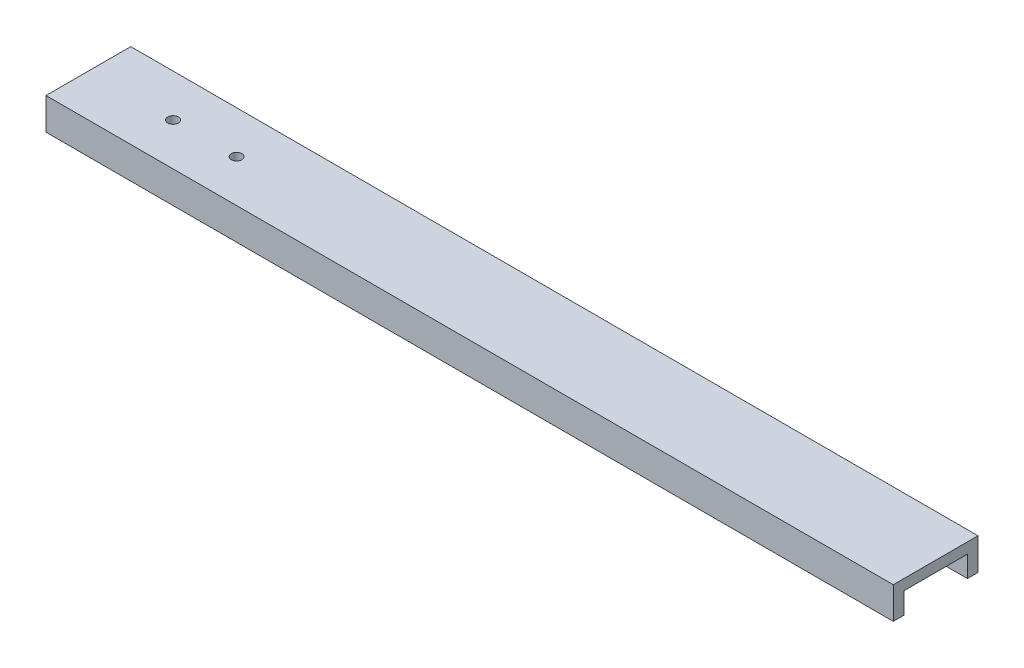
ISO-10303-21;
HEADER;
FILE_DESCRIPTION(('STEP AP214'),'2;1');
FILE_NAME('part.step','',(''),(''),'','','');
FILE_SCHEMA(('AUTOMOTIVE_DESIGN { 1 0 10303 214 1 1 1 1 }'));
ENDSEC;
DATA;
#1=APPLICATION_CONTEXT('core data for automotive mechanical design processes');
#2=APPLICATION_PROTOCOL_DEFINITION('international standard','automotive_design',2000,#1);
#3=PRODUCT_CONTEXT('',#1,'mechanical');
#4=PRODUCT('Part','Part','',(#3));
#5=PRODUCT_RELATED_PRODUCT_CATEGORY('part','',(#4));
#6=PRODUCT_DEFINITION_FORMATION('','',#4);
#7=PRODUCT_DEFINITION_CONTEXT('part definition',#1,'design');
#8=PRODUCT_DEFINITION('design','',#6,#7);
#9=PRODUCT_DEFINITION_SHAPE('','',#8);
#10=(LENGTH_UNIT() NAMED_UNIT(*) SI_UNIT(.MILLI.,.METRE.));
#11=(NAMED_UNIT(*) PLANE_ANGLE_UNIT() SI_UNIT($,.RADIAN.));
#12=(NAMED_UNIT(*) SI_UNIT($,.STERADIAN.) SOLID_ANGLE_UNIT());
#13=UNCERTAINTY_MEASURE_WITH_UNIT(LENGTH_MEASURE(1.E-05),#10,'distance_accuracy_value','');
#14=(GEOMETRIC_REPRESENTATION_CONTEXT(3) GLOBAL_UNCERTAINTY_ASSIGNED_CONTEXT((#13)) GLOBAL_UNIT_ASSIGNED_CONTEXT((#10,
#11,#12)) REPRESENTATION_CONTEXT('',''));
#15=CARTESIAN_POINT('',(0.,0.,0.));
#16=DIRECTION('',(0.,0.,1.));
#17=DIRECTION('',(1.,0.,0.));
#18=AXIS2_PLACEMENT_3D('',#15,#16,#17);
#19=CARTESIAN_POINT('',(254.,-12.7,19.05));
#20=DIRECTION('',(0.,1.,0.));
#21=DIRECTION('',(0.,0.,1.));
#22=AXIS2_PLACEMENT_3D('',#19,#20,#21);
#23=PLANE('',#22);
#24=DIRECTION('',(0.,0.,-1.));
#25=VECTOR('',#24,1.);
#26=CARTESIAN_POINT('',(-254.,-12.7,19.05));
#27=LINE('',#26,#25);
#28=CARTESIAN_POINT('',(-254.,-12.7,25.4));
#29=VERTEX_POINT('',#28);
#30=CARTESIAN_POINT('',(-254.,-12.7,19.05));
#31=VERTEX_POINT('',#30);
#32=EDGE_CURVE('E140',#29,#31,#27,.T.);
#33=ORIENTED_EDGE('',*,*,#32,.T.);
#34=DIRECTION('',(-1.,0.,0.));
#35=VECTOR('',#34,1.);
#36=CARTESIAN_POINT('',(254.,-12.7,19.05));
#37=LINE('',#36,#35);
#38=CARTESIAN_POINT('',(254.,-12.7,19.05));
#39=VERTEX_POINT('',#38);
#40=EDGE_CURVE('E11',#39,#31,#37,.T.);
#41=ORIENTED_EDGE('',*,*,#40,.F.);
#42=DIRECTION('',(0.,0.,-1.));
#43=VECTOR('',#42,1.);
#44=CARTESIAN_POINT('',(254.,-12.7,19.05));
#45=LINE('',#44,#43);
#46=CARTESIAN_POINT('',(254.,-12.7,25.4));
#47=VERTEX_POINT('',#46);
#48=EDGE_CURVE('E163',#47,#39,#45,.T.);
#49=ORIENTED_EDGE('',*,*,#48,.F.);
#50=DIRECTION('',(-1.,0.,0.));
#51=VECTOR('',#50,1.);
#52=CARTESIAN_POINT('',(254.,-12.7,25.4));
#53=LINE('',#52,#51);
#54=EDGE_CURVE('E136',#47,#29,#53,.T.);
#55=ORIENTED_EDGE('',*,*,#54,.T.);
#56=EDGE_LOOP('',(#33,#41,#49,#55));
#57=FACE_BOUND('',#56,.T.);
#58=ADVANCED_FACE('F39',(#57),#23,.F.);
#59=CARTESIAN_POINT('',(254.,0.,19.05));
#60=DIRECTION('',(0.,0.,1.));
#61=DIRECTION('',(0.,-1.,0.));
#62=AXIS2_PLACEMENT_3D('',#59,#60,#61);
#63=PLANE('',#62);
#64=DIRECTION('',(0.,1.,0.));
#65=VECTOR('',#64,1.);
#66=CARTESIAN_POINT('',(-254.,0.,19.05));
#67=LINE('',#66,#65);
#68=CARTESIAN_POINT('',(-254.,0.,19.05));
#69=VERTEX_POINT('',#68);
#70=EDGE_CURVE('E144',#31,#69,#67,.T.);
#71=ORIENTED_EDGE('',*,*,#70,.T.);
#72=DIRECTION('',(-1.,0.,0.));
#73=VECTOR('',#72,1.);
#74=CARTESIAN_POINT('',(254.,0.,19.05));
#75=LINE('',#74,#73);
#76=CARTESIAN_POINT('',(254.,0.,19.05));
#77=VERTEX_POINT('',#76);
#78=EDGE_CURVE('E48',#77,#69,#75,.T.);
#79=ORIENTED_EDGE('',*,*,#78,.F.);
#80=DIRECTION('',(0.,1.,0.));
#81=VECTOR('',#80,1.);
#82=CARTESIAN_POINT('',(254.,0.,19.05));
#83=LINE('',#82,#81);
#84=EDGE_CURVE('E99',#39,#77,#83,.T.);
#85=ORIENTED_EDGE('',*,*,#84,.F.);
#86=ORIENTED_EDGE('',*,*,#40,.T.);
#87=EDGE_LOOP('',(#71,#79,#85,#86));
#88=FACE_BOUND('',#87,.T.);
#89=ADVANCED_FACE('F239',(#88),#63,.F.);
#90=CARTESIAN_POINT('',(254.,0.,-19.05));
#91=DIRECTION('',(0.,1.,0.));
#92=DIRECTION('',(0.,0.,1.));
#93=AXIS2_PLACEMENT_3D('',#90,#91,#92);
#94=PLANE('',#93);
#95=CARTESIAN_POINT('',(-203.2,0.,0.));
#96=DIRECTION('',(0.,1.,0.));
#97=DIRECTION('',(0.,0.,1.));
#98=AXIS2_PLACEMENT_3D('',#95,#96,#97);
#99=CIRCLE('',#98,3.175);
#100=CARTESIAN_POINT('',(-203.2,0.,3.175));
#101=VERTEX_POINT('',#100);
#102=EDGE_CURVE('E145',#101,#101,#99,.T.);
#103=ORIENTED_EDGE('',*,*,#102,.T.);
#104=EDGE_LOOP('',(#103));
#105=FACE_BOUND('',#104,.T.);
#106=CARTESIAN_POINT('',(-165.1,0.,0.));
#107=DIRECTION('',(0.,1.,0.));
#108=DIRECTION('',(0.,0.,1.));
#109=AXIS2_PLACEMENT_3D('',#106,#107,#108);
#110=CIRCLE('',#109,3.175);
#111=CARTESIAN_POINT('',(-165.1,0.,3.175));
#112=VERTEX_POINT('',#111);
#113=EDGE_CURVE('E210',#112,#112,#110,.T.);
#114=ORIENTED_EDGE('',*,*,#113,.T.);
#115=EDGE_LOOP('',(#114));
#116=FACE_BOUND('',#115,.T.);
#117=DIRECTION('',(0.,0.,-1.));
#118=VECTOR('',#117,1.);
#119=CARTESIAN_POINT('',(-254.,0.,-19.05));
#120=LINE('',#119,#118);
#121=CARTESIAN_POINT('',(-254.,0.,-19.05));
#122=VERTEX_POINT('',#121);
#123=EDGE_CURVE('E148',#69,#122,#120,.T.);
#124=ORIENTED_EDGE('',*,*,#123,.T.);
#125=DIRECTION('',(-1.,0.,0.));
#126=VECTOR('',#125,1.);
#127=CARTESIAN_POINT('',(254.,0.,-19.05));
#128=LINE('',#127,#126);
#129=CARTESIAN_POINT('',(254.,0.,-19.05));
#130=VERTEX_POINT('',#129);
#131=EDGE_CURVE('E174',#130,#122,#128,.T.);
#132=ORIENTED_EDGE('',*,*,#131,.F.);
#133=DIRECTION('',(0.,0.,-1.));
#134=VECTOR('',#133,1.);
#135=CARTESIAN_POINT('',(254.,0.,-19.05));
#136=LINE('',#135,#134);
#137=EDGE_CURVE('E184',#77,#130,#136,.T.);
#138=ORIENTED_EDGE('',*,*,#137,.F.);
#139=ORIENTED_EDGE('',*,*,#78,.T.);
#140=EDGE_LOOP('',(#124,#132,#138,#139));
#141=FACE_BOUND('',#140,.T.);
#142=ADVANCED_FACE('F182',(#105,#116,#141),#94,.F.);
#143=CARTESIAN_POINT('',(254.,-12.7,-19.05));
#144=DIRECTION('',(0.,0.,-1.));
#145=DIRECTION('',(-1.,0.,0.));
#146=AXIS2_PLACEMENT_3D('',#143,#144,#145);
#147=PLANE('',#146);
#148=DIRECTION('',(0.,-1.,0.));
#149=VECTOR('',#148,1.);
#150=CARTESIAN_POINT('',(-254.,-12.7,-19.05));
#151=LINE('',#150,#149);
#152=CARTESIAN_POINT('',(-254.,-12.7,-19.05));
#153=VERTEX_POINT('',#152);
#154=EDGE_CURVE('E151',#122,#153,#151,.T.);
#155=ORIENTED_EDGE('',*,*,#154,.T.);
#156=DIRECTION('',(-1.,0.,0.));
#157=VECTOR('',#156,1.);
#158=CARTESIAN_POINT('',(254.,-12.7,-19.05));
#159=LINE('',#158,#157);
#160=CARTESIAN_POINT('',(254.,-12.7,-19.05));
#161=VERTEX_POINT('',#160);
#162=EDGE_CURVE('E170',#161,#153,#159,.T.);
#163=ORIENTED_EDGE('',*,*,#162,.F.);
#164=DIRECTION('',(0.,-1.,0.));
#165=VECTOR('',#164,1.);
#166=CARTESIAN_POINT('',(254.,-12.7,-19.05));
#167=LINE('',#166,#165);
#168=EDGE_CURVE('E197',#130,#161,#167,.T.);
#169=ORIENTED_EDGE('',*,*,#168,.F.);
#170=ORIENTED_EDGE('',*,*,#131,.T.);
#171=EDGE_LOOP('',(#155,#163,#169,#170));
#172=FACE_BOUND('',#171,.T.);
#173=ADVANCED_FACE('F192',(#172),#147,.F.);
#174=CARTESIAN_POINT('',(254.,-12.7,-25.4));
#175=DIRECTION('',(0.,1.,0.));
#176=DIRECTION('',(0.,0.,1.));
#177=AXIS2_PLACEMENT_3D('',#174,#175,#176);
#178=PLANE('',#177);
#179=DIRECTION('',(0.,0.,-1.));
#180=VECTOR('',#179,1.);
#181=CARTESIAN_POINT('',(-254.,-12.7,-25.4));
#182=LINE('',#181,#180);
#183=CARTESIAN_POINT('',(-254.,-12.7,-25.4));
#184=VERTEX_POINT('',#183);
#185=EDGE_CURVE('E154',#153,#184,#182,.T.);
#186=ORIENTED_EDGE('',*,*,#185,.T.);
#187=DIRECTION('',(-1.,0.,0.));
#188=VECTOR('',#187,1.);
#189=CARTESIAN_POINT('',(254.,-12.7,-25.4));
#190=LINE('',#189,#188);
#191=CARTESIAN_POINT('',(254.,-12.7,-25.4));
#192=VERTEX_POINT('',#191);
#193=EDGE_CURVE('E129',#192,#184,#190,.T.);
#194=ORIENTED_EDGE('',*,*,#193,.F.);
#195=DIRECTION('',(0.,0.,-1.));
#196=VECTOR('',#195,1.);
#197=CARTESIAN_POINT('',(254.,-12.7,-25.4));
#198=LINE('',#197,#196);
#199=EDGE_CURVE('E118',#161,#192,#198,.T.);
#200=ORIENTED_EDGE('',*,*,#199,.F.);
#201=ORIENTED_EDGE('',*,*,#162,.T.);
#202=EDGE_LOOP('',(#186,#194,#200,#201));
#203=FACE_BOUND('',#202,.T.);
#204=ADVANCED_FACE('F195',(#203),#178,.F.);
#205=CARTESIAN_POINT('',(254.,6.35000000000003,-25.4));
#206=DIRECTION('',(0.,0.,1.));
#207=DIRECTION('',(0.,-1.,0.));
#208=AXIS2_PLACEMENT_3D('',#205,#206,#207);
#209=PLANE('',#208);
#210=DIRECTION('',(0.,1.,0.));
#211=VECTOR('',#210,1.);
#212=CARTESIAN_POINT('',(-254.,6.35000000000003,-25.4));
#213=LINE('',#212,#211);
#214=CARTESIAN_POINT('',(-254.,6.35000000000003,-25.4));
#215=VERTEX_POINT('',#214);
#216=EDGE_CURVE('E127',#184,#215,#213,.T.);
#217=ORIENTED_EDGE('',*,*,#216,.T.);
#218=DIRECTION('',(-1.,0.,0.));
#219=VECTOR('',#218,1.);
#220=CARTESIAN_POINT('',(254.,6.35000000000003,-25.4));
#221=LINE('',#220,#219);
#222=CARTESIAN_POINT('',(254.,6.35000000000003,-25.4));
#223=VERTEX_POINT('',#222);
#224=EDGE_CURVE('E124',#223,#215,#221,.T.);
#225=ORIENTED_EDGE('',*,*,#224,.F.);
#226=DIRECTION('',(0.,1.,0.));
#227=VECTOR('',#226,1.);
#228=CARTESIAN_POINT('',(254.,6.35000000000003,-25.4));
#229=LINE('',#228,#227);
#230=EDGE_CURVE('E112',#192,#223,#229,.T.);
#231=ORIENTED_EDGE('',*,*,#230,.F.);
#232=ORIENTED_EDGE('',*,*,#193,.T.);
#233=EDGE_LOOP('',(#217,#225,#231,#232));
#234=FACE_BOUND('',#233,.T.);
#235=ADVANCED_FACE('F125',(#234),#209,.F.);
#236=CARTESIAN_POINT('',(254.,6.35000000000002,25.4));
#237=DIRECTION('',(0.,-1.,0.));
#238=DIRECTION('',(0.,0.,-1.));
#239=AXIS2_PLACEMENT_3D('',#236,#237,#238);
#240=PLANE('',#239);
#241=CARTESIAN_POINT('',(-203.2,6.35000000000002,0.));
#242=DIRECTION('',(0.,1.,0.));
#243=DIRECTION('',(0.,0.,1.));
#244=AXIS2_PLACEMENT_3D('',#241,#242,#243);
#245=CIRCLE('',#244,3.175);
#246=CARTESIAN_POINT('',(-203.2,6.35000000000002,3.175));
#247=VERTEX_POINT('',#246);
#248=EDGE_CURVE('E214',#247,#247,#245,.T.);
#249=ORIENTED_EDGE('',*,*,#248,.F.);
#250=EDGE_LOOP('',(#249));
#251=FACE_BOUND('',#250,.T.);
#252=CARTESIAN_POINT('',(-165.1,6.35000000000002,0.));
#253=DIRECTION('',(0.,1.,0.));
#254=DIRECTION('',(0.,0.,1.));
#255=AXIS2_PLACEMENT_3D('',#252,#253,#254);
#256=CIRCLE('',#255,3.175);
#257=CARTESIAN_POINT('',(-165.1,6.35000000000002,3.175));
#258=VERTEX_POINT('',#257);
#259=EDGE_CURVE('E215',#258,#258,#256,.T.);
#260=ORIENTED_EDGE('',*,*,#259,.F.);
#261=EDGE_LOOP('',(#260));
#262=FACE_BOUND('',#261,.T.);
#263=DIRECTION('',(0.,0.,1.));
#264=VECTOR('',#263,1.);
#265=CARTESIAN_POINT('',(-254.,6.35000000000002,25.4));
#266=LINE('',#265,#264);
#267=CARTESIAN_POINT('',(-254.,6.35000000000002,25.4));
#268=VERTEX_POINT('',#267);
#269=EDGE_CURVE('E85',#215,#268,#266,.T.);
#270=ORIENTED_EDGE('',*,*,#269,.T.);
#271=DIRECTION('',(-1.,0.,0.));
#272=VECTOR('',#271,1.);
#273=CARTESIAN_POINT('',(254.,6.35000000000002,25.4));
#274=LINE('',#273,#272);
#275=CARTESIAN_POINT('',(254.,6.35000000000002,25.4));
#276=VERTEX_POINT('',#275);
#277=EDGE_CURVE('E130',#276,#268,#274,.T.);
#278=ORIENTED_EDGE('',*,*,#277,.F.);
#279=DIRECTION('',(0.,0.,1.));
#280=VECTOR('',#279,1.);
#281=CARTESIAN_POINT('',(254.,6.35000000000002,25.4));
#282=LINE('',#281,#280);
#283=EDGE_CURVE('E116',#223,#276,#282,.T.);
#284=ORIENTED_EDGE('',*,*,#283,.F.);
#285=ORIENTED_EDGE('',*,*,#224,.T.);
#286=EDGE_LOOP('',(#270,#278,#284,#285));
#287=FACE_BOUND('',#286,.T.);
#288=ADVANCED_FACE('F132',(#251,#262,#287),#240,.F.);
#289=CARTESIAN_POINT('',(254.,-12.7,25.4));
#290=DIRECTION('',(0.,0.,-1.));
#291=DIRECTION('',(0.,1.,0.));
#292=AXIS2_PLACEMENT_3D('',#289,#290,#291);
#293=PLANE('',#292);
#294=DIRECTION('',(0.,-1.,0.));
#295=VECTOR('',#294,1.);
#296=CARTESIAN_POINT('',(-254.,-12.7,25.4));
#297=LINE('',#296,#295);
#298=EDGE_CURVE('E91',#268,#29,#297,.T.);
#299=ORIENTED_EDGE('',*,*,#298,.T.);
#300=ORIENTED_EDGE('',*,*,#54,.F.);
#301=DIRECTION('',(0.,-1.,0.));
#302=VECTOR('',#301,1.);
#303=CARTESIAN_POINT('',(254.,-12.7,25.4));
#304=LINE('',#303,#302);
#305=EDGE_CURVE('E56',#276,#47,#304,.T.);
#306=ORIENTED_EDGE('',*,*,#305,.F.);
#307=ORIENTED_EDGE('',*,*,#277,.T.);
#308=EDGE_LOOP('',(#299,#300,#306,#307));
#309=FACE_BOUND('',#308,.T.);
#310=ADVANCED_FACE('F228',(#309),#293,.F.);
#311=CARTESIAN_POINT('',(254.,0.,0.));
#312=DIRECTION('',(-1.,0.,0.));
#313=DIRECTION('',(0.,0.,1.));
#314=AXIS2_PLACEMENT_3D('',#311,#312,#313);
#315=PLANE('',#314);
#316=ORIENTED_EDGE('',*,*,#48,.T.);
#317=ORIENTED_EDGE('',*,*,#84,.T.);
#318=ORIENTED_EDGE('',*,*,#137,.T.);
#319=ORIENTED_EDGE('',*,*,#168,.T.);
#320=ORIENTED_EDGE('',*,*,#199,.T.);
#321=ORIENTED_EDGE('',*,*,#230,.T.);
#322=ORIENTED_EDGE('',*,*,#283,.T.);
#323=ORIENTED_EDGE('',*,*,#305,.T.);
#324=EDGE_LOOP('',(#316,#317,#318,#319,#320,#321,#322,#323));
#325=FACE_BOUND('',#324,.T.);
#326=ADVANCED_FACE('F114',(#325),#315,.F.);
#327=CARTESIAN_POINT('',(-254.,0.,0.));
#328=DIRECTION('',(-1.,0.,0.));
#329=DIRECTION('',(0.,0.,1.));
#330=AXIS2_PLACEMENT_3D('',#327,#328,#329);
#331=PLANE('',#330);
#332=ORIENTED_EDGE('',*,*,#32,.F.);
#333=ORIENTED_EDGE('',*,*,#298,.F.);
#334=ORIENTED_EDGE('',*,*,#269,.F.);
#335=ORIENTED_EDGE('',*,*,#216,.F.);
#336=ORIENTED_EDGE('',*,*,#185,.F.);
#337=ORIENTED_EDGE('',*,*,#154,.F.);
#338=ORIENTED_EDGE('',*,*,#123,.F.);
#339=ORIENTED_EDGE('',*,*,#70,.F.);
#340=EDGE_LOOP('',(#332,#333,#334,#335,#336,#337,#338,#339));
#341=FACE_BOUND('',#340,.T.);
#342=ADVANCED_FACE('F188',(#341),#331,.T.);
#343=CARTESIAN_POINT('',(-165.1,-12.7,0.));
#344=DIRECTION('',(0.,1.,0.));
#345=DIRECTION('',(0.,0.,1.));
#346=AXIS2_PLACEMENT_3D('',#343,#344,#345);
#347=CYLINDRICAL_SURFACE('',#346,3.175);
#348=ORIENTED_EDGE('',*,*,#259,.T.);
#349=EDGE_LOOP('',(#348));
#350=FACE_BOUND('',#349,.T.);
#351=ORIENTED_EDGE('',*,*,#113,.F.);
#352=EDGE_LOOP('',(#351));
#353=FACE_BOUND('',#352,.T.);
#354=ADVANCED_FACE('F232',(#350,#353),#347,.F.);
#355=CARTESIAN_POINT('',(-203.2,-12.7,0.));
#356=DIRECTION('',(0.,1.,0.));
#357=DIRECTION('',(0.,0.,1.));
#358=AXIS2_PLACEMENT_3D('',#355,#356,#357);
#359=CYLINDRICAL_SURFACE('',#358,3.175);
#360=ORIENTED_EDGE('',*,*,#248,.T.);
#361=EDGE_LOOP('',(#360));
#362=FACE_BOUND('',#361,.T.);
#363=ORIENTED_EDGE('',*,*,#102,.F.);
#364=EDGE_LOOP('',(#363));
#365=FACE_BOUND('',#364,.T.);
#366=ADVANCED_FACE('F223',(#362,#365),#359,.F.);
#367=CLOSED_SHELL('',(#58,#89,#142,#173,#204,#235,#288,#310,#326,#342,#354,#366));
#368=MANIFOLD_SOLID_BREP('B2',#367);
#369=ADVANCED_BREP_SHAPE_REPRESENTATION('',(#18,#368),#14);
#370=SHAPE_DEFINITION_REPRESENTATION(#9,#369);
ENDSEC;
END-ISO-10303-21;
